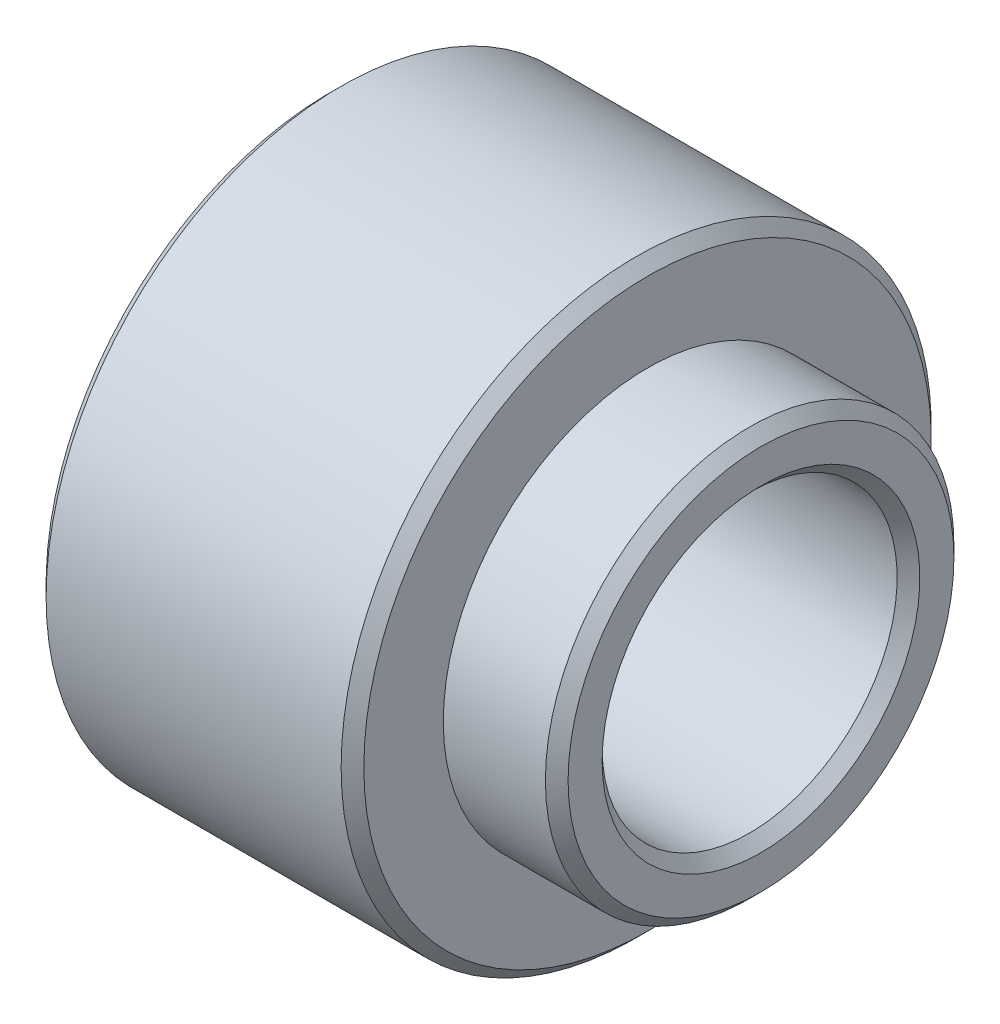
ISO-10303-21;
HEADER;
FILE_DESCRIPTION(('STEP AP214'),'2;1');
FILE_NAME('part.step','',(''),(''),'','','');
FILE_SCHEMA(('AUTOMOTIVE_DESIGN { 1 0 10303 214 1 1 1 1 }'));
ENDSEC;
DATA;
#1=APPLICATION_CONTEXT('core data for automotive mechanical design processes');
#2=APPLICATION_PROTOCOL_DEFINITION('international standard','automotive_design',2000,#1);
#3=PRODUCT_CONTEXT('',#1,'mechanical');
#4=PRODUCT('Part','Part','',(#3));
#5=PRODUCT_RELATED_PRODUCT_CATEGORY('part','',(#4));
#6=PRODUCT_DEFINITION_FORMATION('','',#4);
#7=PRODUCT_DEFINITION_CONTEXT('part definition',#1,'design');
#8=PRODUCT_DEFINITION('design','',#6,#7);
#9=PRODUCT_DEFINITION_SHAPE('','',#8);
#10=(LENGTH_UNIT() NAMED_UNIT(*) SI_UNIT(.MILLI.,.METRE.));
#11=(NAMED_UNIT(*) PLANE_ANGLE_UNIT() SI_UNIT($,.RADIAN.));
#12=(NAMED_UNIT(*) SI_UNIT($,.STERADIAN.) SOLID_ANGLE_UNIT());
#13=UNCERTAINTY_MEASURE_WITH_UNIT(LENGTH_MEASURE(1.E-05),#10,'distance_accuracy_value','');
#14=(GEOMETRIC_REPRESENTATION_CONTEXT(3) GLOBAL_UNCERTAINTY_ASSIGNED_CONTEXT((#13)) GLOBAL_UNIT_ASSIGNED_CONTEXT((#10,
#11,#12)) REPRESENTATION_CONTEXT('',''));
#15=CARTESIAN_POINT('',(0.,0.,0.));
#16=DIRECTION('',(0.,0.,1.));
#17=DIRECTION('',(1.,0.,0.));
#18=AXIS2_PLACEMENT_3D('',#15,#16,#17);
#19=CARTESIAN_POINT('',(0.,13.,0.));
#20=DIRECTION('',(1.,0.,0.));
#21=DIRECTION('',(0.,0.,-1.));
#22=AXIS2_PLACEMENT_3D('',#19,#20,#21);
#23=PLANE('',#22);
#24=CARTESIAN_POINT('',(0.,0.,0.));
#25=DIRECTION('',(1.,0.,0.));
#26=DIRECTION('',(0.,0.,-1.));
#27=AXIS2_PLACEMENT_3D('',#24,#25,#26);
#28=CIRCLE('',#27,12.5);
#29=CARTESIAN_POINT('',(0.,0.,-12.5));
#30=VERTEX_POINT('',#29);
#31=EDGE_CURVE('E65',#30,#30,#28,.F.);
#32=ORIENTED_EDGE('',*,*,#31,.T.);
#33=EDGE_LOOP('',(#32));
#34=FACE_BOUND('',#33,.T.);
#35=CARTESIAN_POINT('',(0.,0.,0.));
#36=DIRECTION('',(-1.,0.,0.));
#37=DIRECTION('',(0.,0.,1.));
#38=AXIS2_PLACEMENT_3D('',#35,#36,#37);
#39=CIRCLE('',#38,11.);
#40=CARTESIAN_POINT('',(0.,0.,11.));
#41=VERTEX_POINT('',#40);
#42=EDGE_CURVE('E68',#41,#41,#39,.T.);
#43=ORIENTED_EDGE('',*,*,#42,.F.);
#44=EDGE_LOOP('',(#43));
#45=FACE_BOUND('',#44,.T.);
#46=ADVANCED_FACE('F36',(#34,#45),#23,.F.);
#47=CARTESIAN_POINT('',(0.,0.,0.));
#48=DIRECTION('',(-1.,0.,0.));
#49=DIRECTION('',(0.,0.,1.));
#50=AXIS2_PLACEMENT_3D('',#47,#48,#49);
#51=CONICAL_SURFACE('',#50,11.,0.5235987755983);
#52=CARTESIAN_POINT('',(7.79422863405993,0.,0.));
#53=DIRECTION('',(-1.,0.,0.));
#54=DIRECTION('',(0.,0.,1.));
#55=AXIS2_PLACEMENT_3D('',#52,#53,#54);
#56=CIRCLE('',#55,6.5);
#57=CARTESIAN_POINT('',(7.79422863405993,0.,6.5));
#58=VERTEX_POINT('',#57);
#59=EDGE_CURVE('E71',#58,#58,#56,.T.);
#60=ORIENTED_EDGE('',*,*,#59,.F.);
#61=EDGE_LOOP('',(#60));
#62=FACE_BOUND('',#61,.T.);
#63=ORIENTED_EDGE('',*,*,#42,.T.);
#64=EDGE_LOOP('',(#63));
#65=FACE_BOUND('',#64,.T.);
#66=ADVANCED_FACE('F94',(#62,#65),#51,.F.);
#67=CARTESIAN_POINT('',(0.,0.,0.));
#68=DIRECTION('',(-1.,0.,0.));
#69=DIRECTION('',(0.,0.,1.));
#70=AXIS2_PLACEMENT_3D('',#67,#68,#69);
#71=CYLINDRICAL_SURFACE('',#70,6.5);
#72=CARTESIAN_POINT('',(18.5,0.,0.));
#73=DIRECTION('',(-1.,0.,0.));
#74=DIRECTION('',(0.,0.,1.));
#75=AXIS2_PLACEMENT_3D('',#72,#73,#74);
#76=CIRCLE('',#75,6.5);
#77=CARTESIAN_POINT('',(18.5,0.,6.5));
#78=VERTEX_POINT('',#77);
#79=EDGE_CURVE('E47',#78,#78,#76,.F.);
#80=ORIENTED_EDGE('',*,*,#79,.T.);
#81=EDGE_LOOP('',(#80));
#82=FACE_BOUND('',#81,.T.);
#83=ORIENTED_EDGE('',*,*,#59,.T.);
#84=EDGE_LOOP('',(#83));
#85=FACE_BOUND('',#84,.T.);
#86=ADVANCED_FACE('F90',(#82,#85),#71,.F.);
#87=CARTESIAN_POINT('',(19.,6.5,0.));
#88=DIRECTION('',(-1.,0.,0.));
#89=DIRECTION('',(0.,0.,1.));
#90=AXIS2_PLACEMENT_3D('',#87,#88,#89);
#91=PLANE('',#90);
#92=CARTESIAN_POINT('',(19.,0.,0.));
#93=DIRECTION('',(-1.,0.,0.));
#94=DIRECTION('',(0.,0.,1.));
#95=AXIS2_PLACEMENT_3D('',#92,#93,#94);
#96=CIRCLE('',#95,7.);
#97=CARTESIAN_POINT('',(19.,0.,7.));
#98=VERTEX_POINT('',#97);
#99=EDGE_CURVE('E51',#98,#98,#96,.T.);
#100=ORIENTED_EDGE('',*,*,#99,.T.);
#101=EDGE_LOOP('',(#100));
#102=FACE_BOUND('',#101,.T.);
#103=CARTESIAN_POINT('',(19.,0.,0.));
#104=DIRECTION('',(-1.,0.,0.));
#105=DIRECTION('',(0.,0.,1.));
#106=AXIS2_PLACEMENT_3D('',#103,#104,#105);
#107=CIRCLE('',#106,8.49999999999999);
#108=CARTESIAN_POINT('',(19.,0.,8.49999999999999));
#109=VERTEX_POINT('',#108);
#110=EDGE_CURVE('E56',#109,#109,#107,.F.);
#111=ORIENTED_EDGE('',*,*,#110,.T.);
#112=EDGE_LOOP('',(#111));
#113=FACE_BOUND('',#112,.T.);
#114=ADVANCED_FACE('F82',(#102,#113),#91,.F.);
#115=CARTESIAN_POINT('',(0.,0.,0.));
#116=DIRECTION('',(-1.,0.,0.));
#117=DIRECTION('',(0.,0.,1.));
#118=AXIS2_PLACEMENT_3D('',#115,#116,#117);
#119=CYLINDRICAL_SURFACE('',#118,9.);
#120=CARTESIAN_POINT('',(18.5,0.,0.));
#121=DIRECTION('',(-1.,0.,0.));
#122=DIRECTION('',(0.,0.,1.));
#123=AXIS2_PLACEMENT_3D('',#120,#121,#122);
#124=CIRCLE('',#123,9.);
#125=CARTESIAN_POINT('',(18.5,0.,9.));
#126=VERTEX_POINT('',#125);
#127=EDGE_CURVE('E10',#126,#126,#124,.T.);
#128=ORIENTED_EDGE('',*,*,#127,.T.);
#129=EDGE_LOOP('',(#128));
#130=FACE_BOUND('',#129,.T.);
#131=CARTESIAN_POINT('',(14.,0.,0.));
#132=DIRECTION('',(-1.,0.,0.));
#133=DIRECTION('',(0.,0.,1.));
#134=AXIS2_PLACEMENT_3D('',#131,#132,#133);
#135=CIRCLE('',#134,9.);
#136=CARTESIAN_POINT('',(14.,0.,9.));
#137=VERTEX_POINT('',#136);
#138=EDGE_CURVE('E74',#137,#137,#135,.T.);
#139=ORIENTED_EDGE('',*,*,#138,.F.);
#140=EDGE_LOOP('',(#139));
#141=FACE_BOUND('',#140,.T.);
#142=ADVANCED_FACE('F80',(#130,#141),#119,.T.);
#143=CARTESIAN_POINT('',(14.,9.,0.));
#144=DIRECTION('',(-1.,0.,0.));
#145=DIRECTION('',(0.,0.,1.));
#146=AXIS2_PLACEMENT_3D('',#143,#144,#145);
#147=PLANE('',#146);
#148=CARTESIAN_POINT('',(14.,0.,0.));
#149=DIRECTION('',(-1.,0.,0.));
#150=DIRECTION('',(0.,0.,1.));
#151=AXIS2_PLACEMENT_3D('',#148,#149,#150);
#152=CIRCLE('',#151,12.5);
#153=CARTESIAN_POINT('',(14.,0.,12.5));
#154=VERTEX_POINT('',#153);
#155=EDGE_CURVE('E43',#154,#154,#152,.F.);
#156=ORIENTED_EDGE('',*,*,#155,.T.);
#157=EDGE_LOOP('',(#156));
#158=FACE_BOUND('',#157,.T.);
#159=ORIENTED_EDGE('',*,*,#138,.T.);
#160=EDGE_LOOP('',(#159));
#161=FACE_BOUND('',#160,.T.);
#162=ADVANCED_FACE('F78',(#158,#161),#147,.F.);
#163=CARTESIAN_POINT('',(0.,0.,0.));
#164=DIRECTION('',(-1.,0.,0.));
#165=DIRECTION('',(0.,0.,1.));
#166=AXIS2_PLACEMENT_3D('',#163,#164,#165);
#167=CYLINDRICAL_SURFACE('',#166,13.);
#168=CARTESIAN_POINT('',(0.500000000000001,0.,0.));
#169=DIRECTION('',(1.,0.,0.));
#170=DIRECTION('',(0.,0.,-1.));
#171=AXIS2_PLACEMENT_3D('',#168,#169,#170);
#172=CIRCLE('',#171,13.);
#173=CARTESIAN_POINT('',(0.500000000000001,0.,-13.));
#174=VERTEX_POINT('',#173);
#175=EDGE_CURVE('E59',#174,#174,#172,.T.);
#176=ORIENTED_EDGE('',*,*,#175,.T.);
#177=EDGE_LOOP('',(#176));
#178=FACE_BOUND('',#177,.T.);
#179=CARTESIAN_POINT('',(13.5,0.,0.));
#180=DIRECTION('',(-1.,0.,0.));
#181=DIRECTION('',(0.,0.,1.));
#182=AXIS2_PLACEMENT_3D('',#179,#180,#181);
#183=CIRCLE('',#182,13.);
#184=CARTESIAN_POINT('',(13.5,0.,13.));
#185=VERTEX_POINT('',#184);
#186=EDGE_CURVE('E62',#185,#185,#183,.T.);
#187=ORIENTED_EDGE('',*,*,#186,.T.);
#188=EDGE_LOOP('',(#187));
#189=FACE_BOUND('',#188,.T.);
#190=ADVANCED_FACE('F88',(#178,#189),#167,.T.);
#191=CARTESIAN_POINT('',(0.,0.,0.));
#192=DIRECTION('',(1.,0.,0.));
#193=DIRECTION('',(0.,0.,-1.));
#194=AXIS2_PLACEMENT_3D('',#191,#192,#193);
#195=CONICAL_SURFACE('',#194,12.5,0.785398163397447);
#196=ORIENTED_EDGE('',*,*,#175,.F.);
#197=EDGE_LOOP('',(#196));
#198=FACE_BOUND('',#197,.T.);
#199=ORIENTED_EDGE('',*,*,#31,.F.);
#200=EDGE_LOOP('',(#199));
#201=FACE_BOUND('',#200,.T.);
#202=ADVANCED_FACE('F105',(#198,#201),#195,.T.);
#203=CARTESIAN_POINT('',(19.,0.,0.));
#204=DIRECTION('',(1.,0.,0.));
#205=DIRECTION('',(0.,0.,-1.));
#206=AXIS2_PLACEMENT_3D('',#203,#204,#205);
#207=CONICAL_SURFACE('',#206,7.,0.785398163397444);
#208=ORIENTED_EDGE('',*,*,#79,.F.);
#209=EDGE_LOOP('',(#208));
#210=FACE_BOUND('',#209,.T.);
#211=ORIENTED_EDGE('',*,*,#99,.F.);
#212=EDGE_LOOP('',(#211));
#213=FACE_BOUND('',#212,.T.);
#214=ADVANCED_FACE('F108',(#210,#213),#207,.F.);
#215=CARTESIAN_POINT('',(13.5,0.,0.));
#216=DIRECTION('',(-1.,0.,0.));
#217=DIRECTION('',(0.,0.,1.));
#218=AXIS2_PLACEMENT_3D('',#215,#216,#217);
#219=CONICAL_SURFACE('',#218,13.,0.785398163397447);
#220=ORIENTED_EDGE('',*,*,#155,.F.);
#221=EDGE_LOOP('',(#220));
#222=FACE_BOUND('',#221,.T.);
#223=ORIENTED_EDGE('',*,*,#186,.F.);
#224=EDGE_LOOP('',(#223));
#225=FACE_BOUND('',#224,.T.);
#226=ADVANCED_FACE('F111',(#222,#225),#219,.T.);
#227=CARTESIAN_POINT('',(18.5,0.,0.));
#228=DIRECTION('',(-1.,0.,0.));
#229=DIRECTION('',(0.,0.,1.));
#230=AXIS2_PLACEMENT_3D('',#227,#228,#229);
#231=CONICAL_SURFACE('',#230,9.,0.785398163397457);
#232=ORIENTED_EDGE('',*,*,#110,.F.);
#233=EDGE_LOOP('',(#232));
#234=FACE_BOUND('',#233,.T.);
#235=ORIENTED_EDGE('',*,*,#127,.F.);
#236=EDGE_LOOP('',(#235));
#237=FACE_BOUND('',#236,.T.);
#238=ADVANCED_FACE('F38',(#234,#237),#231,.T.);
#239=CLOSED_SHELL('',(#46,#66,#86,#114,#142,#162,#190,#202,#214,#226,#238));
#240=MANIFOLD_SOLID_BREP('B2',#239);
#241=ADVANCED_BREP_SHAPE_REPRESENTATION('',(#18,#240),#14);
#242=SHAPE_DEFINITION_REPRESENTATION(#9,#241);
ENDSEC;
END-ISO-10303-21;
